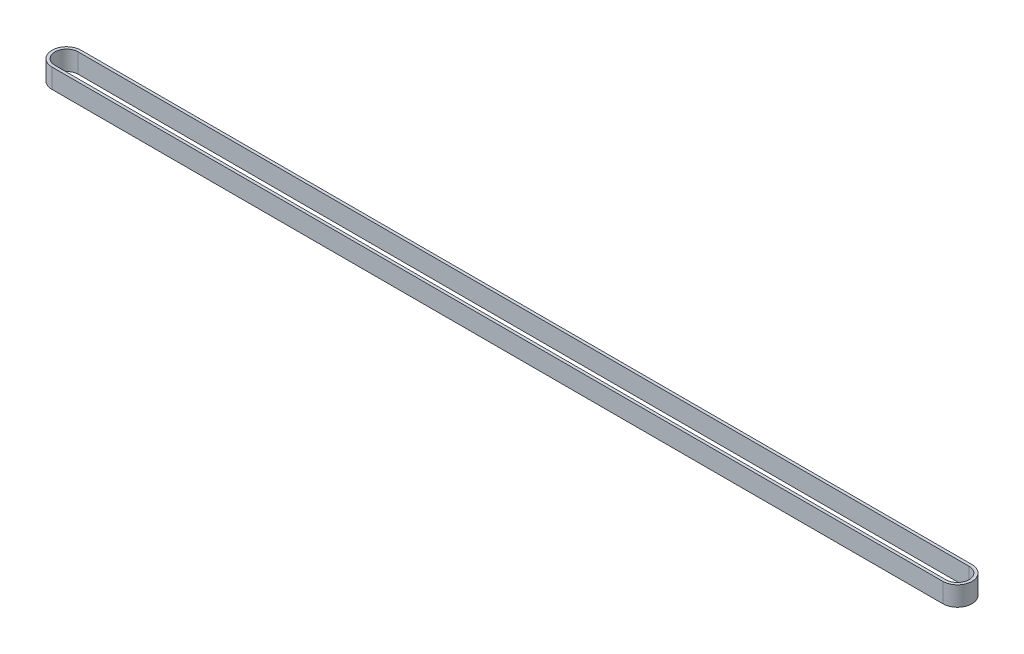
ISO-10303-21;
HEADER;
FILE_DESCRIPTION(('STEP AP214'),'2;1');
FILE_NAME('part.step','',(''),(''),'','','');
FILE_SCHEMA(('AUTOMOTIVE_DESIGN { 1 0 10303 214 1 1 1 1 }'));
ENDSEC;
DATA;
#1=APPLICATION_CONTEXT('core data for automotive mechanical design processes');
#2=APPLICATION_PROTOCOL_DEFINITION('international standard','automotive_design',2000,#1);
#3=PRODUCT_CONTEXT('',#1,'mechanical');
#4=PRODUCT('Part','Part','',(#3));
#5=PRODUCT_RELATED_PRODUCT_CATEGORY('part','',(#4));
#6=PRODUCT_DEFINITION_FORMATION('','',#4);
#7=PRODUCT_DEFINITION_CONTEXT('part definition',#1,'design');
#8=PRODUCT_DEFINITION('design','',#6,#7);
#9=PRODUCT_DEFINITION_SHAPE('','',#8);
#10=(LENGTH_UNIT() NAMED_UNIT(*) SI_UNIT(.MILLI.,.METRE.));
#11=(NAMED_UNIT(*) PLANE_ANGLE_UNIT() SI_UNIT($,.RADIAN.));
#12=(NAMED_UNIT(*) SI_UNIT($,.STERADIAN.) SOLID_ANGLE_UNIT());
#13=UNCERTAINTY_MEASURE_WITH_UNIT(LENGTH_MEASURE(1.E-05),#10,'distance_accuracy_value','');
#14=(GEOMETRIC_REPRESENTATION_CONTEXT(3) GLOBAL_UNCERTAINTY_ASSIGNED_CONTEXT((#13)) GLOBAL_UNIT_ASSIGNED_CONTEXT((#10,
#11,#12)) REPRESENTATION_CONTEXT('',''));
#15=CARTESIAN_POINT('',(0.,0.,0.));
#16=DIRECTION('',(0.,0.,1.));
#17=DIRECTION('',(1.,0.,0.));
#18=AXIS2_PLACEMENT_3D('',#15,#16,#17);
#19=CARTESIAN_POINT('',(458.8,5.,0.));
#20=DIRECTION('',(0.,1.,0.));
#21=DIRECTION('',(0.,0.,1.));
#22=AXIS2_PLACEMENT_3D('',#19,#20,#21);
#23=PLANE('',#22);
#24=CARTESIAN_POINT('',(458.8,5.,0.));
#25=DIRECTION('',(0.,1.,0.));
#26=DIRECTION('',(0.,0.,1.));
#27=AXIS2_PLACEMENT_3D('',#24,#25,#26);
#28=CIRCLE('',#27,7.5);
#29=CARTESIAN_POINT('',(458.8,5.,7.5));
#30=VERTEX_POINT('',#29);
#31=CARTESIAN_POINT('',(458.8,5.,-7.5));
#32=VERTEX_POINT('',#31);
#33=EDGE_CURVE('E135',#30,#32,#28,.T.);
#34=ORIENTED_EDGE('',*,*,#33,.T.);
#35=DIRECTION('',(-1.,0.,0.));
#36=VECTOR('',#35,1.);
#37=CARTESIAN_POINT('',(458.8,5.,-7.5));
#38=LINE('',#37,#36);
#39=CARTESIAN_POINT('',(0.,5.,-7.5));
#40=VERTEX_POINT('',#39);
#41=EDGE_CURVE('E138',#32,#40,#38,.T.);
#42=ORIENTED_EDGE('',*,*,#41,.T.);
#43=CARTESIAN_POINT('',(0.,5.,0.));
#44=DIRECTION('',(0.,1.,0.));
#45=DIRECTION('',(0.,0.,1.));
#46=AXIS2_PLACEMENT_3D('',#43,#44,#45);
#47=CIRCLE('',#46,7.5);
#48=CARTESIAN_POINT('',(0.,5.,7.5));
#49=VERTEX_POINT('',#48);
#50=EDGE_CURVE('E141',#40,#49,#47,.T.);
#51=ORIENTED_EDGE('',*,*,#50,.T.);
#52=DIRECTION('',(1.,0.,0.));
#53=VECTOR('',#52,1.);
#54=CARTESIAN_POINT('',(458.8,5.,7.5));
#55=LINE('',#54,#53);
#56=EDGE_CURVE('E143',#49,#30,#55,.T.);
#57=ORIENTED_EDGE('',*,*,#56,.T.);
#58=EDGE_LOOP('',(#34,#42,#51,#57));
#59=FACE_BOUND('',#58,.T.);
#60=DIRECTION('',(-1.,0.,0.));
#61=VECTOR('',#60,1.);
#62=CARTESIAN_POINT('',(0.,5.,-6.));
#63=LINE('',#62,#61);
#64=CARTESIAN_POINT('',(458.8,5.,-6.));
#65=VERTEX_POINT('',#64);
#66=CARTESIAN_POINT('',(0.,5.,-6.));
#67=VERTEX_POINT('',#66);
#68=EDGE_CURVE('E107',#65,#67,#63,.T.);
#69=ORIENTED_EDGE('',*,*,#68,.F.);
#70=CARTESIAN_POINT('',(458.8,5.,0.));
#71=DIRECTION('',(0.,1.,0.));
#72=DIRECTION('',(0.,0.,1.));
#73=AXIS2_PLACEMENT_3D('',#70,#71,#72);
#74=CIRCLE('',#73,6.);
#75=CARTESIAN_POINT('',(458.8,5.,6.));
#76=VERTEX_POINT('',#75);
#77=EDGE_CURVE('E99',#76,#65,#74,.T.);
#78=ORIENTED_EDGE('',*,*,#77,.F.);
#79=DIRECTION('',(1.,0.,0.));
#80=VECTOR('',#79,1.);
#81=CARTESIAN_POINT('',(458.8,5.,6.));
#82=LINE('',#81,#80);
#83=CARTESIAN_POINT('',(0.,5.,6.));
#84=VERTEX_POINT('',#83);
#85=EDGE_CURVE('E121',#84,#76,#82,.T.);
#86=ORIENTED_EDGE('',*,*,#85,.F.);
#87=CARTESIAN_POINT('',(0.,5.,0.));
#88=DIRECTION('',(0.,1.,0.));
#89=DIRECTION('',(0.,0.,1.));
#90=AXIS2_PLACEMENT_3D('',#87,#88,#89);
#91=CIRCLE('',#90,6.);
#92=EDGE_CURVE('E119',#67,#84,#91,.T.);
#93=ORIENTED_EDGE('',*,*,#92,.F.);
#94=EDGE_LOOP('',(#69,#78,#86,#93));
#95=FACE_BOUND('',#94,.T.);
#96=ADVANCED_FACE('F34',(#59,#95),#23,.T.);
#97=CARTESIAN_POINT('',(458.8,-5.,0.));
#98=DIRECTION('',(0.,1.,0.));
#99=DIRECTION('',(0.,0.,1.));
#100=AXIS2_PLACEMENT_3D('',#97,#98,#99);
#101=PLANE('',#100);
#102=CARTESIAN_POINT('',(458.8,-5.,0.));
#103=DIRECTION('',(0.,1.,0.));
#104=DIRECTION('',(0.,0.,1.));
#105=AXIS2_PLACEMENT_3D('',#102,#103,#104);
#106=CIRCLE('',#105,7.5);
#107=CARTESIAN_POINT('',(458.8,-5.,7.5));
#108=VERTEX_POINT('',#107);
#109=CARTESIAN_POINT('',(458.8,-5.,-7.5));
#110=VERTEX_POINT('',#109);
#111=EDGE_CURVE('E115',#108,#110,#106,.T.);
#112=ORIENTED_EDGE('',*,*,#111,.F.);
#113=DIRECTION('',(1.,0.,0.));
#114=VECTOR('',#113,1.);
#115=CARTESIAN_POINT('',(458.8,-5.,7.5));
#116=LINE('',#115,#114);
#117=CARTESIAN_POINT('',(0.,-5.,7.5));
#118=VERTEX_POINT('',#117);
#119=EDGE_CURVE('E139',#118,#108,#116,.T.);
#120=ORIENTED_EDGE('',*,*,#119,.F.);
#121=CARTESIAN_POINT('',(0.,-5.,0.));
#122=DIRECTION('',(0.,1.,0.));
#123=DIRECTION('',(0.,0.,1.));
#124=AXIS2_PLACEMENT_3D('',#121,#122,#123);
#125=CIRCLE('',#124,7.5);
#126=CARTESIAN_POINT('',(0.,-5.,-7.5));
#127=VERTEX_POINT('',#126);
#128=EDGE_CURVE('E150',#127,#118,#125,.T.);
#129=ORIENTED_EDGE('',*,*,#128,.F.);
#130=DIRECTION('',(-1.,0.,0.));
#131=VECTOR('',#130,1.);
#132=CARTESIAN_POINT('',(458.8,-5.,-7.5));
#133=LINE('',#132,#131);
#134=EDGE_CURVE('E148',#110,#127,#133,.T.);
#135=ORIENTED_EDGE('',*,*,#134,.F.);
#136=EDGE_LOOP('',(#112,#120,#129,#135));
#137=FACE_BOUND('',#136,.T.);
#138=CARTESIAN_POINT('',(458.8,-5.,0.));
#139=DIRECTION('',(0.,1.,0.));
#140=DIRECTION('',(0.,0.,1.));
#141=AXIS2_PLACEMENT_3D('',#138,#139,#140);
#142=CIRCLE('',#141,6.);
#143=CARTESIAN_POINT('',(458.8,-5.,6.));
#144=VERTEX_POINT('',#143);
#145=CARTESIAN_POINT('',(458.8,-5.,-6.));
#146=VERTEX_POINT('',#145);
#147=EDGE_CURVE('E57',#144,#146,#142,.T.);
#148=ORIENTED_EDGE('',*,*,#147,.T.);
#149=DIRECTION('',(-1.,0.,0.));
#150=VECTOR('',#149,1.);
#151=CARTESIAN_POINT('',(0.,-5.,-6.));
#152=LINE('',#151,#150);
#153=CARTESIAN_POINT('',(0.,-5.,-6.));
#154=VERTEX_POINT('',#153);
#155=EDGE_CURVE('E114',#146,#154,#152,.T.);
#156=ORIENTED_EDGE('',*,*,#155,.T.);
#157=CARTESIAN_POINT('',(0.,-5.,0.));
#158=DIRECTION('',(0.,1.,0.));
#159=DIRECTION('',(0.,0.,1.));
#160=AXIS2_PLACEMENT_3D('',#157,#158,#159);
#161=CIRCLE('',#160,6.);
#162=CARTESIAN_POINT('',(0.,-5.,6.));
#163=VERTEX_POINT('',#162);
#164=EDGE_CURVE('E127',#154,#163,#161,.T.);
#165=ORIENTED_EDGE('',*,*,#164,.T.);
#166=DIRECTION('',(1.,0.,0.));
#167=VECTOR('',#166,1.);
#168=CARTESIAN_POINT('',(458.8,-5.,6.));
#169=LINE('',#168,#167);
#170=EDGE_CURVE('E108',#163,#144,#169,.T.);
#171=ORIENTED_EDGE('',*,*,#170,.T.);
#172=EDGE_LOOP('',(#148,#156,#165,#171));
#173=FACE_BOUND('',#172,.T.);
#174=ADVANCED_FACE('F168',(#137,#173),#101,.F.);
#175=CARTESIAN_POINT('',(458.8,5.,0.));
#176=DIRECTION('',(0.,-1.,0.));
#177=DIRECTION('',(0.,0.,-1.));
#178=AXIS2_PLACEMENT_3D('',#175,#176,#177);
#179=CYLINDRICAL_SURFACE('',#178,7.5);
#180=ORIENTED_EDGE('',*,*,#111,.T.);
#181=DIRECTION('',(0.,-1.,0.));
#182=VECTOR('',#181,1.);
#183=CARTESIAN_POINT('',(458.8,5.,-7.5));
#184=LINE('',#183,#182);
#185=EDGE_CURVE('E11',#32,#110,#184,.T.);
#186=ORIENTED_EDGE('',*,*,#185,.F.);
#187=ORIENTED_EDGE('',*,*,#33,.F.);
#188=DIRECTION('',(0.,-1.,0.));
#189=VECTOR('',#188,1.);
#190=CARTESIAN_POINT('',(458.8,5.,7.5));
#191=LINE('',#190,#189);
#192=EDGE_CURVE('E145',#30,#108,#191,.T.);
#193=ORIENTED_EDGE('',*,*,#192,.T.);
#194=EDGE_LOOP('',(#180,#186,#187,#193));
#195=FACE_BOUND('',#194,.T.);
#196=ADVANCED_FACE('F36',(#195),#179,.T.);
#197=CARTESIAN_POINT('',(458.8,5.,-7.5));
#198=DIRECTION('',(0.,0.,1.));
#199=DIRECTION('',(1.,0.,0.));
#200=AXIS2_PLACEMENT_3D('',#197,#198,#199);
#201=PLANE('',#200);
#202=ORIENTED_EDGE('',*,*,#134,.T.);
#203=DIRECTION('',(0.,-1.,0.));
#204=VECTOR('',#203,1.);
#205=CARTESIAN_POINT('',(0.,5.,-7.5));
#206=LINE('',#205,#204);
#207=EDGE_CURVE('E42',#40,#127,#206,.T.);
#208=ORIENTED_EDGE('',*,*,#207,.F.);
#209=ORIENTED_EDGE('',*,*,#41,.F.);
#210=ORIENTED_EDGE('',*,*,#185,.T.);
#211=EDGE_LOOP('',(#202,#208,#209,#210));
#212=FACE_BOUND('',#211,.T.);
#213=ADVANCED_FACE('F178',(#212),#201,.F.);
#214=CARTESIAN_POINT('',(0.,5.,0.));
#215=DIRECTION('',(0.,-1.,0.));
#216=DIRECTION('',(0.,0.,-1.));
#217=AXIS2_PLACEMENT_3D('',#214,#215,#216);
#218=CYLINDRICAL_SURFACE('',#217,7.5);
#219=ORIENTED_EDGE('',*,*,#128,.T.);
#220=DIRECTION('',(0.,-1.,0.));
#221=VECTOR('',#220,1.);
#222=CARTESIAN_POINT('',(0.,5.,7.5));
#223=LINE('',#222,#221);
#224=EDGE_CURVE('E155',#49,#118,#223,.T.);
#225=ORIENTED_EDGE('',*,*,#224,.F.);
#226=ORIENTED_EDGE('',*,*,#50,.F.);
#227=ORIENTED_EDGE('',*,*,#207,.T.);
#228=EDGE_LOOP('',(#219,#225,#226,#227));
#229=FACE_BOUND('',#228,.T.);
#230=ADVANCED_FACE('F162',(#229),#218,.T.);
#231=CARTESIAN_POINT('',(458.8,5.,7.5));
#232=DIRECTION('',(0.,0.,-1.));
#233=DIRECTION('',(-1.,0.,0.));
#234=AXIS2_PLACEMENT_3D('',#231,#232,#233);
#235=PLANE('',#234);
#236=ORIENTED_EDGE('',*,*,#119,.T.);
#237=ORIENTED_EDGE('',*,*,#192,.F.);
#238=ORIENTED_EDGE('',*,*,#56,.F.);
#239=ORIENTED_EDGE('',*,*,#224,.T.);
#240=EDGE_LOOP('',(#236,#237,#238,#239));
#241=FACE_BOUND('',#240,.T.);
#242=ADVANCED_FACE('F172',(#241),#235,.F.);
#243=CARTESIAN_POINT('',(458.8,5.,0.));
#244=DIRECTION('',(0.,-1.,0.));
#245=DIRECTION('',(0.,0.,-1.));
#246=AXIS2_PLACEMENT_3D('',#243,#244,#245);
#247=CYLINDRICAL_SURFACE('',#246,6.);
#248=ORIENTED_EDGE('',*,*,#147,.F.);
#249=DIRECTION('',(0.,-1.,0.));
#250=VECTOR('',#249,1.);
#251=CARTESIAN_POINT('',(458.8,5.,6.));
#252=LINE('',#251,#250);
#253=EDGE_CURVE('E103',#76,#144,#252,.T.);
#254=ORIENTED_EDGE('',*,*,#253,.F.);
#255=ORIENTED_EDGE('',*,*,#77,.T.);
#256=DIRECTION('',(0.,-1.,0.));
#257=VECTOR('',#256,1.);
#258=CARTESIAN_POINT('',(458.8,5.,-6.));
#259=LINE('',#258,#257);
#260=EDGE_CURVE('E102',#65,#146,#259,.T.);
#261=ORIENTED_EDGE('',*,*,#260,.T.);
#262=EDGE_LOOP('',(#248,#254,#255,#261));
#263=FACE_BOUND('',#262,.T.);
#264=ADVANCED_FACE('F101',(#263),#247,.F.);
#265=CARTESIAN_POINT('',(0.,5.,-6.));
#266=DIRECTION('',(0.,0.,1.));
#267=DIRECTION('',(1.,0.,0.));
#268=AXIS2_PLACEMENT_3D('',#265,#266,#267);
#269=PLANE('',#268);
#270=ORIENTED_EDGE('',*,*,#155,.F.);
#271=ORIENTED_EDGE('',*,*,#260,.F.);
#272=ORIENTED_EDGE('',*,*,#68,.T.);
#273=DIRECTION('',(0.,-1.,0.));
#274=VECTOR('',#273,1.);
#275=CARTESIAN_POINT('',(0.,5.,-6.));
#276=LINE('',#275,#274);
#277=EDGE_CURVE('E116',#67,#154,#276,.T.);
#278=ORIENTED_EDGE('',*,*,#277,.T.);
#279=EDGE_LOOP('',(#270,#271,#272,#278));
#280=FACE_BOUND('',#279,.T.);
#281=ADVANCED_FACE('F111',(#280),#269,.T.);
#282=CARTESIAN_POINT('',(0.,5.,0.));
#283=DIRECTION('',(0.,-1.,0.));
#284=DIRECTION('',(0.,0.,-1.));
#285=AXIS2_PLACEMENT_3D('',#282,#283,#284);
#286=CYLINDRICAL_SURFACE('',#285,6.);
#287=ORIENTED_EDGE('',*,*,#164,.F.);
#288=ORIENTED_EDGE('',*,*,#277,.F.);
#289=ORIENTED_EDGE('',*,*,#92,.T.);
#290=DIRECTION('',(0.,-1.,0.));
#291=VECTOR('',#290,1.);
#292=CARTESIAN_POINT('',(0.,5.,6.));
#293=LINE('',#292,#291);
#294=EDGE_CURVE('E49',#84,#163,#293,.T.);
#295=ORIENTED_EDGE('',*,*,#294,.T.);
#296=EDGE_LOOP('',(#287,#288,#289,#295));
#297=FACE_BOUND('',#296,.T.);
#298=ADVANCED_FACE('F201',(#297),#286,.F.);
#299=CARTESIAN_POINT('',(458.8,5.,6.));
#300=DIRECTION('',(0.,0.,-1.));
#301=DIRECTION('',(-1.,0.,0.));
#302=AXIS2_PLACEMENT_3D('',#299,#300,#301);
#303=PLANE('',#302);
#304=ORIENTED_EDGE('',*,*,#170,.F.);
#305=ORIENTED_EDGE('',*,*,#294,.F.);
#306=ORIENTED_EDGE('',*,*,#85,.T.);
#307=ORIENTED_EDGE('',*,*,#253,.T.);
#308=EDGE_LOOP('',(#304,#305,#306,#307));
#309=FACE_BOUND('',#308,.T.);
#310=ADVANCED_FACE('F205',(#309),#303,.T.);
#311=CLOSED_SHELL('',(#96,#174,#196,#213,#230,#242,#264,#281,#298,#310));
#312=MANIFOLD_SOLID_BREP('B2',#311);
#313=ADVANCED_BREP_SHAPE_REPRESENTATION('',(#18,#312),#14);
#314=SHAPE_DEFINITION_REPRESENTATION(#9,#313);
ENDSEC;
END-ISO-10303-21;
